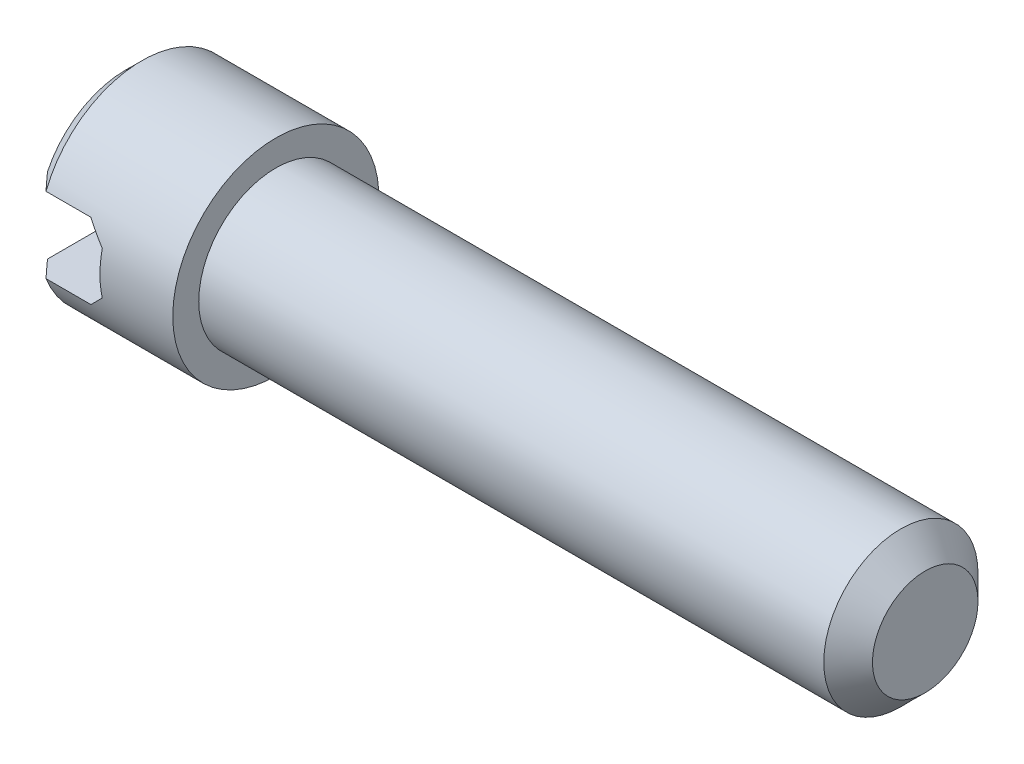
ISO-10303-21;
HEADER;
FILE_DESCRIPTION(('STEP AP214'),'2;1');
FILE_NAME('part.step','',(''),(''),'','','');
FILE_SCHEMA(('AUTOMOTIVE_DESIGN { 1 0 10303 214 1 1 1 1 }'));
ENDSEC;
DATA;
#1=APPLICATION_CONTEXT('core data for automotive mechanical design processes');
#2=APPLICATION_PROTOCOL_DEFINITION('international standard','automotive_design',2000,#1);
#3=PRODUCT_CONTEXT('',#1,'mechanical');
#4=PRODUCT('Part','Part','',(#3));
#5=PRODUCT_RELATED_PRODUCT_CATEGORY('part','',(#4));
#6=PRODUCT_DEFINITION_FORMATION('','',#4);
#7=PRODUCT_DEFINITION_CONTEXT('part definition',#1,'design');
#8=PRODUCT_DEFINITION('design','',#6,#7);
#9=PRODUCT_DEFINITION_SHAPE('','',#8);
#10=(LENGTH_UNIT() NAMED_UNIT(*) SI_UNIT(.MILLI.,.METRE.));
#11=(NAMED_UNIT(*) PLANE_ANGLE_UNIT() SI_UNIT($,.RADIAN.));
#12=(NAMED_UNIT(*) SI_UNIT($,.STERADIAN.) SOLID_ANGLE_UNIT());
#13=UNCERTAINTY_MEASURE_WITH_UNIT(LENGTH_MEASURE(1.E-05),#10,'distance_accuracy_value','');
#14=(GEOMETRIC_REPRESENTATION_CONTEXT(3) GLOBAL_UNCERTAINTY_ASSIGNED_CONTEXT((#13)) GLOBAL_UNIT_ASSIGNED_CONTEXT((#10,
#11,#12)) REPRESENTATION_CONTEXT('',''));
#15=CARTESIAN_POINT('',(0.,0.,0.));
#16=DIRECTION('',(0.,0.,1.));
#17=DIRECTION('',(1.,0.,0.));
#18=AXIS2_PLACEMENT_3D('',#15,#16,#17);
#19=CARTESIAN_POINT('',(1.85,1.27,0.));
#20=DIRECTION('',(-1.,0.,0.));
#21=DIRECTION('',(0.,0.,1.));
#22=AXIS2_PLACEMENT_3D('',#19,#20,#21);
#23=PLANE('',#22);
#24=CARTESIAN_POINT('',(1.85,0.,0.));
#25=DIRECTION('',(-1.,0.,0.));
#26=DIRECTION('',(0.,0.,1.));
#27=AXIS2_PLACEMENT_3D('',#24,#25,#26);
#28=CIRCLE('',#27,1.27);
#29=CARTESIAN_POINT('',(1.85,0.,1.27));
#30=VERTEX_POINT('',#29);
#31=EDGE_CURVE('E103',#30,#30,#28,.T.);
#32=ORIENTED_EDGE('',*,*,#31,.F.);
#33=EDGE_LOOP('',(#32));
#34=FACE_BOUND('',#33,.T.);
#35=CARTESIAN_POINT('',(1.85,0.,0.));
#36=DIRECTION('',(-1.,0.,0.));
#37=DIRECTION('',(0.,0.,1.));
#38=AXIS2_PLACEMENT_3D('',#35,#36,#37);
#39=CIRCLE('',#38,0.95);
#40=CARTESIAN_POINT('',(1.85,0.,0.95));
#41=VERTEX_POINT('',#40);
#42=EDGE_CURVE('E142',#41,#41,#39,.F.);
#43=ORIENTED_EDGE('',*,*,#42,.F.);
#44=EDGE_LOOP('',(#43));
#45=FACE_BOUND('',#44,.T.);
#46=ADVANCED_FACE('F30',(#34,#45),#23,.F.);
#47=CARTESIAN_POINT('',(0.2,0.,0.));
#48=DIRECTION('',(1.,0.,0.));
#49=DIRECTION('',(0.,0.,-1.));
#50=AXIS2_PLACEMENT_3D('',#47,#48,#49);
#51=CONICAL_SURFACE('',#50,1.27,0.785398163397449);
#52=CARTESIAN_POINT('',(0.2,0.,0.));
#53=DIRECTION('',(-1.,0.,0.));
#54=DIRECTION('',(0.,0.,1.));
#55=AXIS2_PLACEMENT_3D('',#52,#53,#54);
#56=CIRCLE('',#55,1.27);
#57=CARTESIAN_POINT('',(0.2,0.465549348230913,1.18159375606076));
#58=VERTEX_POINT('',#57);
#59=CARTESIAN_POINT('',(0.2,0.465549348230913,-1.18159375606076));
#60=VERTEX_POINT('',#59);
#61=EDGE_CURVE('E124',#58,#60,#56,.T.);
#62=ORIENTED_EDGE('',*,*,#61,.T.);
#63=CARTESIAN_POINT('',(1.72891710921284,0.465549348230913,-2.75992767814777));
#64=CARTESIAN_POINT('',(1.65265745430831,0.465549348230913,-2.68258700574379));
#65=CARTESIAN_POINT('',(1.5764391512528,0.465549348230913,-2.60520549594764));
#66=CARTESIAN_POINT('',(1.42405610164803,0.465549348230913,-2.45026151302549));
#67=CARTESIAN_POINT('',(1.347891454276,0.465549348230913,-2.3726989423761));
#68=CARTESIAN_POINT('',(1.19455336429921,0.465549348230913,-2.2162382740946));
#69=CARTESIAN_POINT('',(1.11738227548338,0.465549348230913,-2.13733786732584));
#70=CARTESIAN_POINT('',(0.963325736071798,0.465549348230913,-1.97938793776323));
#71=CARTESIAN_POINT('',(0.886440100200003,0.465549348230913,-1.90033859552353));
#72=CARTESIAN_POINT('',(0.694769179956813,0.465549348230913,-1.70251689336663));
#73=CARTESIAN_POINT('',(0.580172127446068,0.465549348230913,-1.5835612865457));
#74=CARTESIAN_POINT('',(0.40907663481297,0.465549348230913,-1.40401289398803));
#75=CARTESIAN_POINT('',(0.352091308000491,0.465549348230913,-1.34388445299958));
#76=CARTESIAN_POINT('',(0.238625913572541,0.465549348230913,-1.22319009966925));
#77=CARTESIAN_POINT('',(0.18214567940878,0.465549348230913,-1.16262434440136));
#78=CARTESIAN_POINT('',(0.0706381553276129,0.465549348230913,-1.04156934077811));
#79=CARTESIAN_POINT('',(0.0156015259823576,0.465549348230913,-0.981088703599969));
#80=CARTESIAN_POINT('',(-0.0933661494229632,0.465549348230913,-0.858984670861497));
#81=CARTESIAN_POINT('',(-0.147295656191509,0.465549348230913,-0.797359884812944));
#82=CARTESIAN_POINT('',(-0.226396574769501,0.465549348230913,-0.703705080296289));
#83=CARTESIAN_POINT('',(-0.252393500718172,0.465549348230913,-0.672374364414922));
#84=CARTESIAN_POINT('',(-0.303602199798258,0.465549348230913,-0.609079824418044));
#85=CARTESIAN_POINT('',(-0.328814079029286,0.465549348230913,-0.57711608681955));
#86=CARTESIAN_POINT('',(-0.378030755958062,0.465549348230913,-0.512374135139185));
#87=CARTESIAN_POINT('',(-0.402037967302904,0.465549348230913,-0.479597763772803));
#88=CARTESIAN_POINT('',(-0.448258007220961,0.465549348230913,-0.412810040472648));
#89=CARTESIAN_POINT('',(-0.470472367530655,0.465549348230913,-0.378799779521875));
#90=CARTESIAN_POINT('',(-0.495954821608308,0.465549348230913,-0.335904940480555));
#91=CARTESIAN_POINT('',(-0.500630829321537,0.465549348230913,-0.327855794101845));
#92=CARTESIAN_POINT('',(-0.509803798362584,0.465549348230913,-0.311654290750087));
#93=CARTESIAN_POINT('',(-0.514300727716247,0.465549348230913,-0.303501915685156));
#94=CARTESIAN_POINT('',(-0.527488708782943,0.465549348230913,-0.278881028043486));
#95=CARTESIAN_POINT('',(-0.535877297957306,0.465549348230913,-0.262248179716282));
#96=CARTESIAN_POINT('',(-0.551543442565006,0.465549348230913,-0.228647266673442));
#97=CARTESIAN_POINT('',(-0.558830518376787,0.465549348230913,-0.211683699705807));
#98=CARTESIAN_POINT('',(-0.572101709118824,0.465549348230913,-0.177254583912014));
#99=CARTESIAN_POINT('',(-0.578085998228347,0.465549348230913,-0.159789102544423));
#100=CARTESIAN_POINT('',(-0.591089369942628,0.465549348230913,-0.11521957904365));
#101=CARTESIAN_POINT('',(-0.597052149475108,0.465549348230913,-0.0877872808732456));
#102=CARTESIAN_POINT('',(-0.604131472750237,0.465549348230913,-0.0323436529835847));
#103=CARTESIAN_POINT('',(-0.605260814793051,0.465549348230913,-0.00433404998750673));
#104=CARTESIAN_POINT('',(-0.602451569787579,0.465549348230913,0.0514022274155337));
#105=CARTESIAN_POINT('',(-0.598515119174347,0.465549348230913,0.0791290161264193));
#106=CARTESIAN_POINT('',(-0.586377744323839,0.465549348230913,0.133673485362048));
#107=CARTESIAN_POINT('',(-0.57816269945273,0.465549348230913,0.160487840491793));
#108=CARTESIAN_POINT('',(-0.556159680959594,0.465549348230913,0.219621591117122));
#109=CARTESIAN_POINT('',(-0.541484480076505,0.465549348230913,0.251599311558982));
#110=CARTESIAN_POINT('',(-0.509089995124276,0.465549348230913,0.314000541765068));
#111=CARTESIAN_POINT('',(-0.491363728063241,0.465549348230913,0.344420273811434));
#112=CARTESIAN_POINT('',(-0.453853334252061,0.465549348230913,0.404286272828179));
#113=CARTESIAN_POINT('',(-0.434053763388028,0.465549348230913,0.433722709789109));
#114=CARTESIAN_POINT('',(-0.393210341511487,0.465549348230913,0.491658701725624));
#115=CARTESIAN_POINT('',(-0.372167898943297,0.465549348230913,0.520159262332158));
#116=CARTESIAN_POINT('',(-0.326700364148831,0.465549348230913,0.579804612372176));
#117=CARTESIAN_POINT('',(-0.302168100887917,0.465549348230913,0.610867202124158));
#118=CARTESIAN_POINT('',(-0.252364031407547,0.465549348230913,0.672395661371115));
#119=CARTESIAN_POINT('',(-0.227092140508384,0.465549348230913,0.702861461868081));
#120=CARTESIAN_POINT('',(-0.150481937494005,0.465549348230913,0.793626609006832));
#121=CARTESIAN_POINT('',(-0.098368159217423,0.465549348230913,0.853269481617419));
#122=CARTESIAN_POINT('',(0.00707187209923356,0.465549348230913,0.97162560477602));
#123=CARTESIAN_POINT('',(0.0603998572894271,0.465549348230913,1.03033729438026));
#124=CARTESIAN_POINT('',(0.167753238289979,0.465549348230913,1.14709337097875));
#125=CARTESIAN_POINT('',(0.221778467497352,0.465549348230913,1.20513791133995));
#126=CARTESIAN_POINT('',(0.330056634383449,0.465549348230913,1.32053654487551));
#127=CARTESIAN_POINT('',(0.384307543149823,0.465549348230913,1.37789254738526));
#128=CARTESIAN_POINT('',(0.493134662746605,0.465549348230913,1.49230129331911));
#129=CARTESIAN_POINT('',(0.547710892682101,0.465549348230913,1.54935401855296));
#130=CARTESIAN_POINT('',(0.711701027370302,0.465549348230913,1.72009840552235));
#131=CARTESIAN_POINT('',(0.82145686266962,0.465549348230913,1.83346143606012));
#132=CARTESIAN_POINT('',(0.997592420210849,0.465549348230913,2.01455750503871));
#133=CARTESIAN_POINT('',(1.0638076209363,0.465549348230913,2.08245107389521));
#134=CARTESIAN_POINT('',(1.19639459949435,0.465549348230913,2.21811107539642));
#135=CARTESIAN_POINT('',(1.26276640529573,0.465549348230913,2.28587748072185));
#136=CARTESIAN_POINT('',(1.39572567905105,0.465549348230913,2.42141276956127));
#137=CARTESIAN_POINT('',(1.46231332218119,0.465549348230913,2.48918148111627));
#138=CARTESIAN_POINT('',(1.59556223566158,0.465549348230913,2.62461999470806));
#139=CARTESIAN_POINT('',(1.66222348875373,0.465549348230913,2.69228981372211));
#140=CARTESIAN_POINT('',(1.72891710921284,0.465549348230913,2.75992767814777));
#141=B_SPLINE_CURVE_WITH_KNOTS('',3,(#63,#64,#65,#66,#67,#68,#69,#70,#71,#72,#73,#74,#75,#76,
#77,#78,#79,#80,#81,#82,#83,#84,#85,#86,#87,#88,#89,#90,#91,#92,#93,#94,#95,#96,#97,#98,#99,
#100,#101,#102,#103,#104,#105,#106,#107,#108,#109,#110,#111,#112,#113,#114,#115,#116,#117,#118,
#119,#120,#121,#122,#123,#124,#125,#126,#127,#128,#129,#130,#131,#132,#133,#134,#135,#136,#137,
#138,#139,#140),.UNSPECIFIED.,.F.,.F.,(4,2,2,2,2,2,2,2,2,2,2,2,2,2,2,2,2,2,2,2,2,2,2,2,2,2,2,2,
2,2,2,2,2,2,2,2,2,2,4),(0.,0.325843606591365,0.65196165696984,0.983059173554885,
1.31387900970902,1.80939845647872,2.05792223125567,2.30636078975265,2.55167592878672,
2.79731174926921,2.91943943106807,3.041550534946,3.16340631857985,3.28515686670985,
3.31308126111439,3.34101061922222,3.39686733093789,3.45220964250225,3.50754455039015,
3.59139891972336,3.67503111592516,3.75862805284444,3.84250264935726,3.94778431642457,
4.05331022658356,4.15968723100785,4.26594591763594,4.38467453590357,4.50341680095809,
4.74099373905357,4.9789339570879,5.21681833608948,5.45366244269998,5.69052059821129,
6.16388539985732,6.44839529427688,6.73296056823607,7.01798437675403,7.3029515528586),.UNSPECIFIED.);
#142=CARTESIAN_POINT('',(0.,0.465549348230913,-0.963412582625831));
#143=VERTEX_POINT('',#142);
#144=EDGE_CURVE('E120',#60,#143,#141,.T.);
#145=ORIENTED_EDGE('',*,*,#144,.T.);
#146=CARTESIAN_POINT('',(0.,0.,0.));
#147=DIRECTION('',(-1.,0.,0.));
#148=DIRECTION('',(0.,0.,1.));
#149=AXIS2_PLACEMENT_3D('',#146,#147,#148);
#150=CIRCLE('',#149,1.07);
#151=CARTESIAN_POINT('',(0.,0.465549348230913,0.963412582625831));
#152=VERTEX_POINT('',#151);
#153=EDGE_CURVE('E115',#152,#143,#150,.T.);
#154=ORIENTED_EDGE('',*,*,#153,.F.);
#155=EDGE_CURVE('E189',#152,#58,#141,.T.);
#156=ORIENTED_EDGE('',*,*,#155,.T.);
#157=EDGE_LOOP('',(#62,#145,#154,#156));
#158=FACE_BOUND('',#157,.T.);
#159=ADVANCED_FACE('F160',(#158),#51,.T.);
#160=CARTESIAN_POINT('',(0.,0.,0.));
#161=DIRECTION('',(1.,0.,0.));
#162=DIRECTION('',(0.,0.,-1.));
#163=AXIS2_PLACEMENT_3D('',#160,#161,#162);
#164=PLANE('',#163);
#165=ORIENTED_EDGE('',*,*,#153,.T.);
#166=DIRECTION('',(0.,0.,1.));
#167=VECTOR('',#166,1.);
#168=CARTESIAN_POINT('',(0.,0.465549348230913,0.));
#169=LINE('',#168,#167);
#170=EDGE_CURVE('E102',#143,#152,#169,.T.);
#171=ORIENTED_EDGE('',*,*,#170,.T.);
#172=EDGE_LOOP('',(#165,#171));
#173=FACE_BOUND('',#172,.T.);
#174=ADVANCED_FACE('F165',(#173),#164,.F.);
#175=CARTESIAN_POINT('',(0.,0.,0.));
#176=DIRECTION('',(-1.,0.,0.));
#177=DIRECTION('',(0.,0.,1.));
#178=AXIS2_PLACEMENT_3D('',#175,#176,#177);
#179=CYLINDRICAL_SURFACE('',#178,1.27);
#180=ORIENTED_EDGE('',*,*,#61,.F.);
#181=DIRECTION('',(-1.,0.,0.));
#182=VECTOR('',#181,1.);
#183=CARTESIAN_POINT('',(0.,0.465549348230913,1.18159375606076));
#184=LINE('',#183,#182);
#185=CARTESIAN_POINT('',(0.753445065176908,0.465549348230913,1.18159375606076));
#186=VERTEX_POINT('',#185);
#187=EDGE_CURVE('E195',#58,#186,#184,.F.);
#188=ORIENTED_EDGE('',*,*,#187,.T.);
#189=CARTESIAN_POINT('',(1.21899441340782,0.,0.));
#190=DIRECTION('',(0.707106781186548,0.707106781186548,0.));
#191=DIRECTION('',(-0.707106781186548,0.707106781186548,0.));
#192=AXIS2_PLACEMENT_3D('',#189,#190,#191);
#193=ELLIPSE('',#192,1.79605122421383,1.27);
#194=CARTESIAN_POINT('',(0.953445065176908,0.265549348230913,1.24192735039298));
#195=VERTEX_POINT('',#194);
#196=EDGE_CURVE('E141',#186,#195,#193,.T.);
#197=ORIENTED_EDGE('',*,*,#196,.T.);
#198=CARTESIAN_POINT('',(0.953445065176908,0.,0.));
#199=DIRECTION('',(1.,0.,0.));
#200=DIRECTION('',(0.,0.,-1.));
#201=AXIS2_PLACEMENT_3D('',#198,#199,#200);
#202=CIRCLE('',#201,1.27);
#203=CARTESIAN_POINT('',(0.953445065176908,-0.265549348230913,1.24192735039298));
#204=VERTEX_POINT('',#203);
#205=EDGE_CURVE('E52',#195,#204,#202,.T.);
#206=ORIENTED_EDGE('',*,*,#205,.T.);
#207=CARTESIAN_POINT('',(1.21899441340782,0.,0.));
#208=DIRECTION('',(0.707106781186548,-0.707106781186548,0.));
#209=DIRECTION('',(-0.707106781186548,-0.707106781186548,0.));
#210=AXIS2_PLACEMENT_3D('',#207,#208,#209);
#211=ELLIPSE('',#210,1.79605122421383,1.27);
#212=CARTESIAN_POINT('',(0.753445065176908,-0.465549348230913,1.18159375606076));
#213=VERTEX_POINT('',#212);
#214=EDGE_CURVE('E135',#204,#213,#211,.T.);
#215=ORIENTED_EDGE('',*,*,#214,.T.);
#216=DIRECTION('',(-1.,0.,0.));
#217=VECTOR('',#216,1.);
#218=CARTESIAN_POINT('',(0.,-0.465549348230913,1.18159375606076));
#219=LINE('',#218,#217);
#220=CARTESIAN_POINT('',(0.2,-0.465549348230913,1.18159375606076));
#221=VERTEX_POINT('',#220);
#222=EDGE_CURVE('E111',#213,#221,#219,.T.);
#223=ORIENTED_EDGE('',*,*,#222,.T.);
#224=CARTESIAN_POINT('',(0.2,-0.465549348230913,-1.18159375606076));
#225=VERTEX_POINT('',#224);
#226=EDGE_CURVE('E110',#225,#221,#56,.T.);
#227=ORIENTED_EDGE('',*,*,#226,.F.);
#228=DIRECTION('',(-1.,0.,0.));
#229=VECTOR('',#228,1.);
#230=CARTESIAN_POINT('',(0.,-0.465549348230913,-1.18159375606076));
#231=LINE('',#230,#229);
#232=CARTESIAN_POINT('',(0.753445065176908,-0.465549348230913,-1.18159375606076));
#233=VERTEX_POINT('',#232);
#234=EDGE_CURVE('E112',#225,#233,#231,.F.);
#235=ORIENTED_EDGE('',*,*,#234,.T.);
#236=CARTESIAN_POINT('',(0.953445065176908,-0.265549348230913,-1.24192735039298));
#237=VERTEX_POINT('',#236);
#238=EDGE_CURVE('E131',#233,#237,#211,.T.);
#239=ORIENTED_EDGE('',*,*,#238,.T.);
#240=CARTESIAN_POINT('',(0.953445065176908,0.265549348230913,-1.24192735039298));
#241=VERTEX_POINT('',#240);
#242=EDGE_CURVE('E134',#237,#241,#202,.T.);
#243=ORIENTED_EDGE('',*,*,#242,.T.);
#244=CARTESIAN_POINT('',(0.753445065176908,0.465549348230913,-1.18159375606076));
#245=VERTEX_POINT('',#244);
#246=EDGE_CURVE('E138',#241,#245,#193,.T.);
#247=ORIENTED_EDGE('',*,*,#246,.T.);
#248=DIRECTION('',(-1.,0.,0.));
#249=VECTOR('',#248,1.);
#250=CARTESIAN_POINT('',(0.,0.465549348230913,-1.18159375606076));
#251=LINE('',#250,#249);
#252=EDGE_CURVE('E116',#245,#60,#251,.T.);
#253=ORIENTED_EDGE('',*,*,#252,.T.);
#254=EDGE_LOOP('',(#180,#188,#197,#206,#215,#223,#227,#235,#239,#243,#247,#253));
#255=FACE_BOUND('',#254,.T.);
#256=ORIENTED_EDGE('',*,*,#31,.T.);
#257=EDGE_LOOP('',(#256));
#258=FACE_BOUND('',#257,.T.);
#259=ADVANCED_FACE('F200',(#255,#258),#179,.T.);
#260=ORIENTED_EDGE('',*,*,#226,.T.);
#261=CARTESIAN_POINT('',(1.72891710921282,-0.465549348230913,2.75992767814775));
#262=CARTESIAN_POINT('',(1.65265745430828,-0.465549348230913,2.68258700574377));
#263=CARTESIAN_POINT('',(1.57643915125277,-0.465549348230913,2.60520549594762));
#264=CARTESIAN_POINT('',(1.42405610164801,-0.465549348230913,2.45026151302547));
#265=CARTESIAN_POINT('',(1.34789145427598,-0.465549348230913,2.37269894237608));
#266=CARTESIAN_POINT('',(1.1945533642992,-0.465549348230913,2.21623827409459));
#267=CARTESIAN_POINT('',(1.11738227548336,-0.465549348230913,2.13733786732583));
#268=CARTESIAN_POINT('',(0.963325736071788,-0.465549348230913,1.97938793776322));
#269=CARTESIAN_POINT('',(0.886440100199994,-0.465549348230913,1.90033859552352));
#270=CARTESIAN_POINT('',(0.694769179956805,-0.465549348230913,1.70251689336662));
#271=CARTESIAN_POINT('',(0.580172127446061,-0.465549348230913,1.58356128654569));
#272=CARTESIAN_POINT('',(0.409076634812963,-0.465549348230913,1.40401289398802));
#273=CARTESIAN_POINT('',(0.352091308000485,-0.465549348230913,1.34388445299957));
#274=CARTESIAN_POINT('',(0.238625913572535,-0.465549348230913,1.22319009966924));
#275=CARTESIAN_POINT('',(0.182145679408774,-0.465549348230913,1.16262434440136));
#276=CARTESIAN_POINT('',(0.0706381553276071,-0.465549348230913,1.0415693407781));
#277=CARTESIAN_POINT('',(0.0156015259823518,-0.465549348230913,0.981088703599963));
#278=CARTESIAN_POINT('',(-0.0933661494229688,-0.465549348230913,0.858984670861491));
#279=CARTESIAN_POINT('',(-0.147295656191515,-0.465549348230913,0.797359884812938));
#280=CARTESIAN_POINT('',(-0.226396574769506,-0.465549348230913,0.703705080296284));
#281=CARTESIAN_POINT('',(-0.252393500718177,-0.465549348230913,0.672374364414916));
#282=CARTESIAN_POINT('',(-0.303602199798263,-0.465549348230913,0.609079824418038));
#283=CARTESIAN_POINT('',(-0.32881407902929,-0.465549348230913,0.577116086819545));
#284=CARTESIAN_POINT('',(-0.378030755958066,-0.465549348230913,0.51237413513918));
#285=CARTESIAN_POINT('',(-0.402037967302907,-0.465549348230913,0.479597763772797));
#286=CARTESIAN_POINT('',(-0.448258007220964,-0.465549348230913,0.412810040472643));
#287=CARTESIAN_POINT('',(-0.470472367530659,-0.465549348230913,0.37879977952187));
#288=CARTESIAN_POINT('',(-0.495954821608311,-0.465549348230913,0.335904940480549));
#289=CARTESIAN_POINT('',(-0.50063082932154,-0.465549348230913,0.32785579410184));
#290=CARTESIAN_POINT('',(-0.509803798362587,-0.465549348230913,0.311654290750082));
#291=CARTESIAN_POINT('',(-0.51430072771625,-0.465549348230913,0.303501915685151));
#292=CARTESIAN_POINT('',(-0.527488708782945,-0.465549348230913,0.278881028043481));
#293=CARTESIAN_POINT('',(-0.535877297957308,-0.465549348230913,0.262248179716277));
#294=CARTESIAN_POINT('',(-0.551543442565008,-0.465549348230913,0.228647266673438));
#295=CARTESIAN_POINT('',(-0.558830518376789,-0.465549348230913,0.211683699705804));
#296=CARTESIAN_POINT('',(-0.572101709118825,-0.465549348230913,0.177254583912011));
#297=CARTESIAN_POINT('',(-0.578085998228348,-0.465549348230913,0.15978910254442));
#298=CARTESIAN_POINT('',(-0.591089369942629,-0.465549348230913,0.115219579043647));
#299=CARTESIAN_POINT('',(-0.597052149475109,-0.465549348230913,0.0877872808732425));
#300=CARTESIAN_POINT('',(-0.604131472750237,-0.465549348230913,0.0323436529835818));
#301=CARTESIAN_POINT('',(-0.605260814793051,-0.465549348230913,0.0043340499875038));
#302=CARTESIAN_POINT('',(-0.602451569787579,-0.465549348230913,-0.0514022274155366));
#303=CARTESIAN_POINT('',(-0.598515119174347,-0.465549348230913,-0.0791290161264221));
#304=CARTESIAN_POINT('',(-0.586377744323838,-0.465549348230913,-0.133673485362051));
#305=CARTESIAN_POINT('',(-0.578162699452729,-0.465549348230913,-0.160487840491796));
#306=CARTESIAN_POINT('',(-0.556159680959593,-0.465549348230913,-0.219621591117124));
#307=CARTESIAN_POINT('',(-0.541484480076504,-0.465549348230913,-0.251599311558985));
#308=CARTESIAN_POINT('',(-0.509089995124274,-0.465549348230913,-0.314000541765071));
#309=CARTESIAN_POINT('',(-0.491363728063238,-0.465549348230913,-0.344420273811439));
#310=CARTESIAN_POINT('',(-0.453853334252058,-0.465549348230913,-0.404286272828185));
#311=CARTESIAN_POINT('',(-0.434053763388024,-0.465549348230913,-0.433722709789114));
#312=CARTESIAN_POINT('',(-0.393210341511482,-0.465549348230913,-0.49165870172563));
#313=CARTESIAN_POINT('',(-0.372167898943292,-0.465549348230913,-0.520159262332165));
#314=CARTESIAN_POINT('',(-0.326700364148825,-0.465549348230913,-0.579804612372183));
#315=CARTESIAN_POINT('',(-0.302168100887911,-0.465549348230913,-0.610867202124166));
#316=CARTESIAN_POINT('',(-0.252364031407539,-0.465549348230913,-0.672395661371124));
#317=CARTESIAN_POINT('',(-0.227092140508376,-0.465549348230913,-0.702861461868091));
#318=CARTESIAN_POINT('',(-0.150481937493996,-0.465549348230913,-0.793626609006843));
#319=CARTESIAN_POINT('',(-0.0983681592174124,-0.465549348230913,-0.853269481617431));
#320=CARTESIAN_POINT('',(0.00707187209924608,-0.465549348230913,-0.971625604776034));
#321=CARTESIAN_POINT('',(0.0603998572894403,-0.465549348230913,-1.03033729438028));
#322=CARTESIAN_POINT('',(0.167753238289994,-0.465549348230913,-1.14709337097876));
#323=CARTESIAN_POINT('',(0.221778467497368,-0.465549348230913,-1.20513791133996));
#324=CARTESIAN_POINT('',(0.330056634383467,-0.465549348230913,-1.32053654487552));
#325=CARTESIAN_POINT('',(0.384307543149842,-0.465549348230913,-1.37789254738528));
#326=CARTESIAN_POINT('',(0.493134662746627,-0.465549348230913,-1.49230129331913));
#327=CARTESIAN_POINT('',(0.547710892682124,-0.465549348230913,-1.54935401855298));
#328=CARTESIAN_POINT('',(0.711701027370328,-0.465549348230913,-1.72009840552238));
#329=CARTESIAN_POINT('',(0.821456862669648,-0.465549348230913,-1.83346143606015));
#330=CARTESIAN_POINT('',(0.997592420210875,-0.465549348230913,-2.01455750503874));
#331=CARTESIAN_POINT('',(1.06380762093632,-0.465549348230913,-2.08245107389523));
#332=CARTESIAN_POINT('',(1.19639459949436,-0.465549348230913,-2.21811107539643));
#333=CARTESIAN_POINT('',(1.26276640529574,-0.465549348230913,-2.28587748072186));
#334=CARTESIAN_POINT('',(1.39572567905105,-0.465549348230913,-2.42141276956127));
#335=CARTESIAN_POINT('',(1.46231332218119,-0.465549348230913,-2.48918148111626));
#336=CARTESIAN_POINT('',(1.59556223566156,-0.465549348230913,-2.62461999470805));
#337=CARTESIAN_POINT('',(1.66222348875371,-0.465549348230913,-2.69228981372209));
#338=CARTESIAN_POINT('',(1.72891710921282,-0.465549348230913,-2.75992767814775));
#339=B_SPLINE_CURVE_WITH_KNOTS('',3,(#261,#262,#263,#264,#265,#266,#267,#268,#269,#270,#271,
#272,#273,#274,#275,#276,#277,#278,#279,#280,#281,#282,#283,#284,#285,#286,#287,#288,#289,#290,
#291,#292,#293,#294,#295,#296,#297,#298,#299,#300,#301,#302,#303,#304,#305,#306,#307,#308,#309,
#310,#311,#312,#313,#314,#315,#316,#317,#318,#319,#320,#321,#322,#323,#324,#325,#326,#327,#328,
#329,#330,#331,#332,#333,#334,#335,#336,#337,#338),.UNSPECIFIED.,.F.,.F.,(4,2,2,2,2,2,2,2,2,2,2,
2,2,2,2,2,2,2,2,2,2,2,2,2,2,2,2,2,2,2,2,2,2,2,2,2,2,2,4),(0.,0.32584360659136,0.65196165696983,
0.983059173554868,1.313879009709,1.8093984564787,2.05792223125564,2.30636078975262,
2.55167592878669,2.79731174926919,2.91943943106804,3.04155053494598,3.16340631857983,
3.28515686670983,3.31308126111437,3.3410106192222,3.39686733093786,3.45220964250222,
3.50754455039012,3.59139891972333,3.67503111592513,3.75862805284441,3.84250264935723,
3.94778431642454,4.05331022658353,4.15968723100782,4.26594591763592,4.38467453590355,
4.50341680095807,4.74099373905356,4.97893395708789,5.21681833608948,5.45366244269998,
5.69052059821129,6.16388539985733,6.44839529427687,6.73296056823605,7.01798437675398,
7.30295155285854),.UNSPECIFIED.);
#340=CARTESIAN_POINT('',(0.,-0.465549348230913,0.963412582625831));
#341=VERTEX_POINT('',#340);
#342=EDGE_CURVE('E97',#221,#341,#339,.T.);
#343=ORIENTED_EDGE('',*,*,#342,.T.);
#344=CARTESIAN_POINT('',(0.,-0.465549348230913,-0.96341258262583));
#345=VERTEX_POINT('',#344);
#346=EDGE_CURVE('E108',#345,#341,#150,.T.);
#347=ORIENTED_EDGE('',*,*,#346,.F.);
#348=EDGE_CURVE('E44',#345,#225,#339,.T.);
#349=ORIENTED_EDGE('',*,*,#348,.T.);
#350=EDGE_LOOP('',(#260,#343,#347,#349));
#351=FACE_BOUND('',#350,.T.);
#352=ADVANCED_FACE('F107',(#351),#51,.T.);
#353=ORIENTED_EDGE('',*,*,#346,.T.);
#354=DIRECTION('',(0.,0.,-1.));
#355=VECTOR('',#354,1.);
#356=CARTESIAN_POINT('',(0.,-0.465549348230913,0.));
#357=LINE('',#356,#355);
#358=EDGE_CURVE('E93',#341,#345,#357,.T.);
#359=ORIENTED_EDGE('',*,*,#358,.T.);
#360=EDGE_LOOP('',(#353,#359));
#361=FACE_BOUND('',#360,.T.);
#362=ADVANCED_FACE('F114',(#361),#164,.F.);
#363=CARTESIAN_POINT('',(0.753445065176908,0.465549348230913,-5.));
#364=DIRECTION('',(0.707106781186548,0.707106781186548,0.));
#365=DIRECTION('',(-0.707106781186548,0.707106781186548,0.));
#366=AXIS2_PLACEMENT_3D('',#363,#364,#365);
#367=PLANE('',#366);
#368=DIRECTION('',(0.,0.,1.));
#369=VECTOR('',#368,1.);
#370=CARTESIAN_POINT('',(0.753445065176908,0.465549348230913,-5.));
#371=LINE('',#370,#369);
#372=EDGE_CURVE('E206',#245,#186,#371,.T.);
#373=ORIENTED_EDGE('',*,*,#372,.F.);
#374=ORIENTED_EDGE('',*,*,#246,.F.);
#375=DIRECTION('',(0.,0.,1.));
#376=VECTOR('',#375,1.);
#377=CARTESIAN_POINT('',(0.953445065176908,0.265549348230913,-5.));
#378=LINE('',#377,#376);
#379=EDGE_CURVE('E219',#241,#195,#378,.T.);
#380=ORIENTED_EDGE('',*,*,#379,.T.);
#381=ORIENTED_EDGE('',*,*,#196,.F.);
#382=EDGE_LOOP('',(#373,#374,#380,#381));
#383=FACE_BOUND('',#382,.T.);
#384=ADVANCED_FACE('F186',(#383),#367,.F.);
#385=CARTESIAN_POINT('',(0.953445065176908,0.265549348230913,-5.));
#386=DIRECTION('',(1.,0.,0.));
#387=DIRECTION('',(0.,0.,-1.));
#388=AXIS2_PLACEMENT_3D('',#385,#386,#387);
#389=PLANE('',#388);
#390=ORIENTED_EDGE('',*,*,#379,.F.);
#391=ORIENTED_EDGE('',*,*,#242,.F.);
#392=DIRECTION('',(0.,0.,1.));
#393=VECTOR('',#392,1.);
#394=CARTESIAN_POINT('',(0.953445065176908,-0.265549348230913,-5.));
#395=LINE('',#394,#393);
#396=EDGE_CURVE('E222',#237,#204,#395,.T.);
#397=ORIENTED_EDGE('',*,*,#396,.T.);
#398=ORIENTED_EDGE('',*,*,#205,.F.);
#399=EDGE_LOOP('',(#390,#391,#397,#398));
#400=FACE_BOUND('',#399,.T.);
#401=ADVANCED_FACE('F212',(#400),#389,.F.);
#402=CARTESIAN_POINT('',(0.753445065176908,-0.465549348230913,-5.));
#403=DIRECTION('',(0.707106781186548,-0.707106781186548,0.));
#404=DIRECTION('',(0.707106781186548,0.707106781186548,0.));
#405=AXIS2_PLACEMENT_3D('',#402,#403,#404);
#406=PLANE('',#405);
#407=DIRECTION('',(0.,0.,1.));
#408=VECTOR('',#407,1.);
#409=CARTESIAN_POINT('',(0.753445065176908,-0.465549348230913,-5.));
#410=LINE('',#409,#408);
#411=EDGE_CURVE('E207',#233,#213,#410,.T.);
#412=ORIENTED_EDGE('',*,*,#411,.T.);
#413=ORIENTED_EDGE('',*,*,#214,.F.);
#414=ORIENTED_EDGE('',*,*,#396,.F.);
#415=ORIENTED_EDGE('',*,*,#238,.F.);
#416=EDGE_LOOP('',(#412,#413,#414,#415));
#417=FACE_BOUND('',#416,.T.);
#418=ADVANCED_FACE('F184',(#417),#406,.F.);
#419=CARTESIAN_POINT('',(0.,0.465549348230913,-5.));
#420=DIRECTION('',(0.,1.,0.));
#421=DIRECTION('',(0.,0.,1.));
#422=AXIS2_PLACEMENT_3D('',#419,#420,#421);
#423=PLANE('',#422);
#424=ORIENTED_EDGE('',*,*,#372,.T.);
#425=ORIENTED_EDGE('',*,*,#187,.F.);
#426=ORIENTED_EDGE('',*,*,#155,.F.);
#427=ORIENTED_EDGE('',*,*,#170,.F.);
#428=ORIENTED_EDGE('',*,*,#144,.F.);
#429=ORIENTED_EDGE('',*,*,#252,.F.);
#430=EDGE_LOOP('',(#424,#425,#426,#427,#428,#429));
#431=FACE_BOUND('',#430,.T.);
#432=ADVANCED_FACE('F178',(#431),#423,.F.);
#433=CARTESIAN_POINT('',(0.,-0.465549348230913,-5.));
#434=DIRECTION('',(0.,-1.,0.));
#435=DIRECTION('',(0.,0.,-1.));
#436=AXIS2_PLACEMENT_3D('',#433,#434,#435);
#437=PLANE('',#436);
#438=ORIENTED_EDGE('',*,*,#411,.F.);
#439=ORIENTED_EDGE('',*,*,#234,.F.);
#440=ORIENTED_EDGE('',*,*,#348,.F.);
#441=ORIENTED_EDGE('',*,*,#358,.F.);
#442=ORIENTED_EDGE('',*,*,#342,.F.);
#443=ORIENTED_EDGE('',*,*,#222,.F.);
#444=EDGE_LOOP('',(#438,#439,#440,#441,#442,#443));
#445=FACE_BOUND('',#444,.T.);
#446=ADVANCED_FACE('F96',(#445),#437,.F.);
#447=CARTESIAN_POINT('',(9.85,0.,0.));
#448=DIRECTION('',(-1.,0.,0.));
#449=DIRECTION('',(0.,0.,1.));
#450=AXIS2_PLACEMENT_3D('',#447,#448,#449);
#451=CYLINDRICAL_SURFACE('',#450,0.95);
#452=CARTESIAN_POINT('',(9.55,0.,0.));
#453=DIRECTION('',(1.,0.,0.));
#454=DIRECTION('',(0.,0.,-1.));
#455=AXIS2_PLACEMENT_3D('',#452,#453,#454);
#456=CIRCLE('',#455,0.95);
#457=CARTESIAN_POINT('',(9.55,0.,-0.95));
#458=VERTEX_POINT('',#457);
#459=EDGE_CURVE('E11',#458,#458,#456,.F.);
#460=ORIENTED_EDGE('',*,*,#459,.T.);
#461=EDGE_LOOP('',(#460));
#462=FACE_BOUND('',#461,.T.);
#463=ORIENTED_EDGE('',*,*,#42,.T.);
#464=EDGE_LOOP('',(#463));
#465=FACE_BOUND('',#464,.T.);
#466=ADVANCED_FACE('F156',(#462,#465),#451,.T.);
#467=CARTESIAN_POINT('',(9.85,0.,0.));
#468=DIRECTION('',(1.,0.,0.));
#469=DIRECTION('',(0.,0.,-1.));
#470=AXIS2_PLACEMENT_3D('',#467,#468,#469);
#471=PLANE('',#470);
#472=CARTESIAN_POINT('',(9.85,0.,0.));
#473=DIRECTION('',(1.,0.,0.));
#474=DIRECTION('',(0.,0.,-1.));
#475=AXIS2_PLACEMENT_3D('',#472,#473,#474);
#476=CIRCLE('',#475,0.650000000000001);
#477=CARTESIAN_POINT('',(9.85,0.,-0.650000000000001));
#478=VERTEX_POINT('',#477);
#479=EDGE_CURVE('E37',#478,#478,#476,.T.);
#480=ORIENTED_EDGE('',*,*,#479,.T.);
#481=EDGE_LOOP('',(#480));
#482=FACE_BOUND('',#481,.T.);
#483=ADVANCED_FACE('F147',(#482),#471,.T.);
#484=CARTESIAN_POINT('',(9.85,0.,0.));
#485=DIRECTION('',(-1.,0.,0.));
#486=DIRECTION('',(0.,0.,1.));
#487=AXIS2_PLACEMENT_3D('',#484,#485,#486);
#488=CONICAL_SURFACE('',#487,0.650000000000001,0.785398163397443);
#489=ORIENTED_EDGE('',*,*,#459,.F.);
#490=EDGE_LOOP('',(#489));
#491=FACE_BOUND('',#490,.T.);
#492=ORIENTED_EDGE('',*,*,#479,.F.);
#493=EDGE_LOOP('',(#492));
#494=FACE_BOUND('',#493,.T.);
#495=ADVANCED_FACE('F149',(#491,#494),#488,.T.);
#496=CLOSED_SHELL('',(#46,#159,#174,#259,#352,#362,#384,#401,#418,#432,#446,#466,#483,#495));
#497=MANIFOLD_SOLID_BREP('B2',#496);
#498=ADVANCED_BREP_SHAPE_REPRESENTATION('',(#18,#497),#14);
#499=SHAPE_DEFINITION_REPRESENTATION(#9,#498);
ENDSEC;
END-ISO-10303-21;
